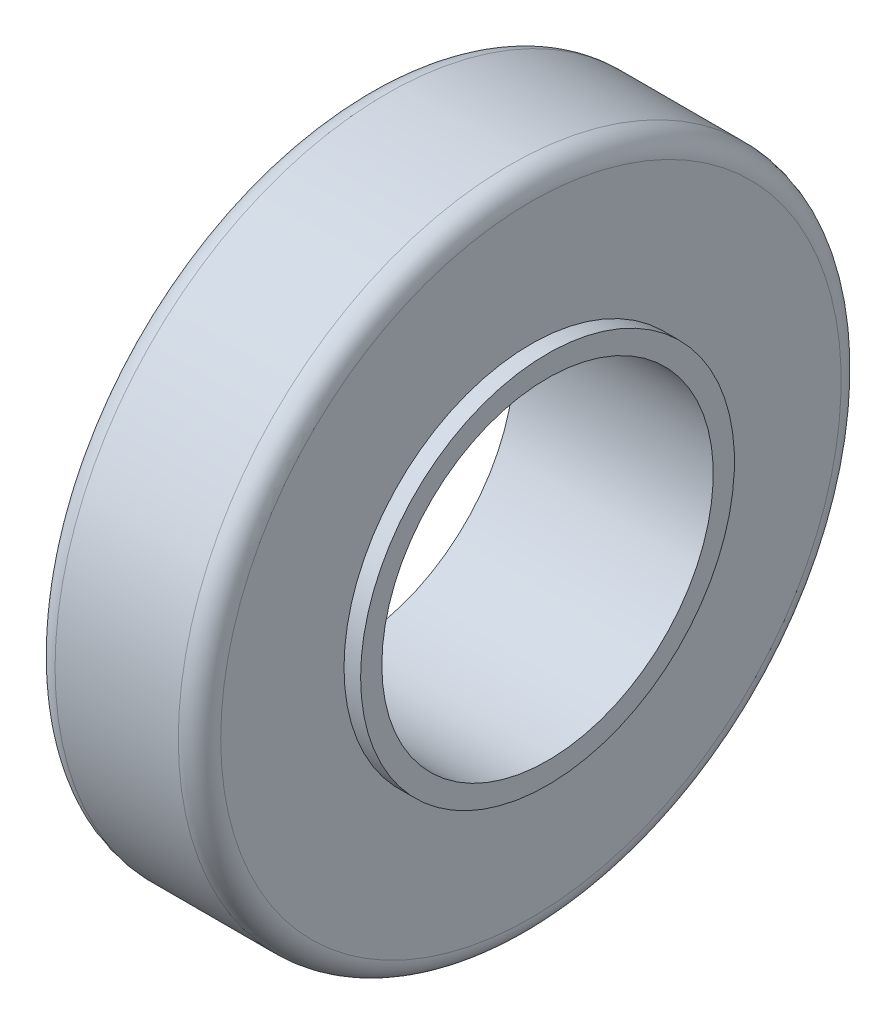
ISO-10303-21;
HEADER;
FILE_DESCRIPTION(('STEP AP214'),'2;1');
FILE_NAME('part.step','',(''),(''),'','','');
FILE_SCHEMA(('AUTOMOTIVE_DESIGN { 1 0 10303 214 1 1 1 1 }'));
ENDSEC;
DATA;
#1=APPLICATION_CONTEXT('core data for automotive mechanical design processes');
#2=APPLICATION_PROTOCOL_DEFINITION('international standard','automotive_design',2000,#1);
#3=PRODUCT_CONTEXT('',#1,'mechanical');
#4=PRODUCT('Part','Part','',(#3));
#5=PRODUCT_RELATED_PRODUCT_CATEGORY('part','',(#4));
#6=PRODUCT_DEFINITION_FORMATION('','',#4);
#7=PRODUCT_DEFINITION_CONTEXT('part definition',#1,'design');
#8=PRODUCT_DEFINITION('design','',#6,#7);
#9=PRODUCT_DEFINITION_SHAPE('','',#8);
#10=(LENGTH_UNIT() NAMED_UNIT(*) SI_UNIT(.MILLI.,.METRE.));
#11=(NAMED_UNIT(*) PLANE_ANGLE_UNIT() SI_UNIT($,.RADIAN.));
#12=(NAMED_UNIT(*) SI_UNIT($,.STERADIAN.) SOLID_ANGLE_UNIT());
#13=UNCERTAINTY_MEASURE_WITH_UNIT(LENGTH_MEASURE(1.E-05),#10,'distance_accuracy_value','');
#14=(GEOMETRIC_REPRESENTATION_CONTEXT(3) GLOBAL_UNCERTAINTY_ASSIGNED_CONTEXT((#13)) GLOBAL_UNIT_ASSIGNED_CONTEXT((#10,
#11,#12)) REPRESENTATION_CONTEXT('',''));
#15=CARTESIAN_POINT('',(0.,0.,0.));
#16=DIRECTION('',(0.,0.,1.));
#17=DIRECTION('',(1.,0.,0.));
#18=AXIS2_PLACEMENT_3D('',#15,#16,#17);
#19=CARTESIAN_POINT('',(-2.38125,4.47675,0.));
#20=DIRECTION('',(1.,0.,0.));
#21=DIRECTION('',(0.,0.,-1.));
#22=AXIS2_PLACEMENT_3D('',#19,#20,#21);
#23=PLANE('',#22);
#24=CARTESIAN_POINT('',(-2.38125,0.,0.));
#25=DIRECTION('',(-1.,0.,0.));
#26=DIRECTION('',(0.,0.,1.));
#27=AXIS2_PLACEMENT_3D('',#24,#25,#26);
#28=CIRCLE('',#27,3.96875);
#29=CARTESIAN_POINT('',(-2.38125,0.,3.96875));
#30=VERTEX_POINT('',#29);
#31=EDGE_CURVE('E52',#30,#30,#28,.T.);
#32=ORIENTED_EDGE('',*,*,#31,.F.);
#33=EDGE_LOOP('',(#32));
#34=FACE_BOUND('',#33,.T.);
#35=CARTESIAN_POINT('',(-2.38125,0.,0.));
#36=DIRECTION('',(-1.,0.,0.));
#37=DIRECTION('',(0.,0.,1.));
#38=AXIS2_PLACEMENT_3D('',#35,#36,#37);
#39=CIRCLE('',#38,4.47675);
#40=CARTESIAN_POINT('',(-2.38125,0.,4.47675));
#41=VERTEX_POINT('',#40);
#42=EDGE_CURVE('E67',#41,#41,#39,.T.);
#43=ORIENTED_EDGE('',*,*,#42,.T.);
#44=EDGE_LOOP('',(#43));
#45=FACE_BOUND('',#44,.T.);
#46=ADVANCED_FACE('F32',(#34,#45),#23,.F.);
#47=CARTESIAN_POINT('',(0.,0.,0.));
#48=DIRECTION('',(-1.,0.,0.));
#49=DIRECTION('',(0.,0.,1.));
#50=AXIS2_PLACEMENT_3D('',#47,#48,#49);
#51=CYLINDRICAL_SURFACE('',#50,3.96875);
#52=CARTESIAN_POINT('',(2.38125,0.,0.));
#53=DIRECTION('',(-1.,0.,0.));
#54=DIRECTION('',(0.,0.,1.));
#55=AXIS2_PLACEMENT_3D('',#52,#53,#54);
#56=CIRCLE('',#55,3.96875);
#57=CARTESIAN_POINT('',(2.38125,0.,3.96875));
#58=VERTEX_POINT('',#57);
#59=EDGE_CURVE('E55',#58,#58,#56,.T.);
#60=ORIENTED_EDGE('',*,*,#59,.F.);
#61=EDGE_LOOP('',(#60));
#62=FACE_BOUND('',#61,.T.);
#63=ORIENTED_EDGE('',*,*,#31,.T.);
#64=EDGE_LOOP('',(#63));
#65=FACE_BOUND('',#64,.T.);
#66=ADVANCED_FACE('F90',(#62,#65),#51,.F.);
#67=CARTESIAN_POINT('',(2.38125,3.96875,0.));
#68=DIRECTION('',(-1.,0.,0.));
#69=DIRECTION('',(0.,0.,1.));
#70=AXIS2_PLACEMENT_3D('',#67,#68,#69);
#71=PLANE('',#70);
#72=CARTESIAN_POINT('',(2.38125,0.,0.));
#73=DIRECTION('',(-1.,0.,0.));
#74=DIRECTION('',(0.,0.,1.));
#75=AXIS2_PLACEMENT_3D('',#72,#73,#74);
#76=CIRCLE('',#75,4.47675);
#77=CARTESIAN_POINT('',(2.38125,0.,4.47675));
#78=VERTEX_POINT('',#77);
#79=EDGE_CURVE('E58',#78,#78,#76,.T.);
#80=ORIENTED_EDGE('',*,*,#79,.F.);
#81=EDGE_LOOP('',(#80));
#82=FACE_BOUND('',#81,.T.);
#83=ORIENTED_EDGE('',*,*,#59,.T.);
#84=EDGE_LOOP('',(#83));
#85=FACE_BOUND('',#84,.T.);
#86=ADVANCED_FACE('F96',(#82,#85),#71,.F.);
#87=CARTESIAN_POINT('',(0.,0.,0.));
#88=DIRECTION('',(-1.,0.,0.));
#89=DIRECTION('',(0.,0.,1.));
#90=AXIS2_PLACEMENT_3D('',#87,#88,#89);
#91=CYLINDRICAL_SURFACE('',#90,4.47675);
#92=CARTESIAN_POINT('',(1.98374,0.,0.));
#93=DIRECTION('',(-1.,0.,0.));
#94=DIRECTION('',(0.,0.,1.));
#95=AXIS2_PLACEMENT_3D('',#92,#93,#94);
#96=CIRCLE('',#95,4.47675);
#97=CARTESIAN_POINT('',(1.98374,0.,4.47675));
#98=VERTEX_POINT('',#97);
#99=EDGE_CURVE('E61',#98,#98,#96,.T.);
#100=ORIENTED_EDGE('',*,*,#99,.F.);
#101=EDGE_LOOP('',(#100));
#102=FACE_BOUND('',#101,.T.);
#103=ORIENTED_EDGE('',*,*,#79,.T.);
#104=EDGE_LOOP('',(#103));
#105=FACE_BOUND('',#104,.T.);
#106=ADVANCED_FACE('F138',(#102,#105),#91,.T.);
#107=CARTESIAN_POINT('',(1.98374,4.47675,0.));
#108=DIRECTION('',(-1.,0.,0.));
#109=DIRECTION('',(0.,0.,1.));
#110=AXIS2_PLACEMENT_3D('',#107,#108,#109);
#111=PLANE('',#110);
#112=CARTESIAN_POINT('',(1.98374,0.,0.));
#113=DIRECTION('',(-1.,0.,0.));
#114=DIRECTION('',(0.,0.,1.));
#115=AXIS2_PLACEMENT_3D('',#112,#113,#114);
#116=CIRCLE('',#115,7.4295);
#117=CARTESIAN_POINT('',(1.98374,0.,7.4295));
#118=VERTEX_POINT('',#117);
#119=EDGE_CURVE('E10',#118,#118,#116,.F.);
#120=ORIENTED_EDGE('',*,*,#119,.T.);
#121=EDGE_LOOP('',(#120));
#122=FACE_BOUND('',#121,.T.);
#123=ORIENTED_EDGE('',*,*,#99,.T.);
#124=EDGE_LOOP('',(#123));
#125=FACE_BOUND('',#124,.T.);
#126=ADVANCED_FACE('F87',(#122,#125),#111,.F.);
#127=CARTESIAN_POINT('',(0.,0.,0.));
#128=DIRECTION('',(-1.,0.,0.));
#129=DIRECTION('',(0.,0.,1.));
#130=AXIS2_PLACEMENT_3D('',#127,#128,#129);
#131=CYLINDRICAL_SURFACE('',#130,7.9375);
#132=CARTESIAN_POINT('',(-1.47574,0.,0.));
#133=DIRECTION('',(1.,0.,0.));
#134=DIRECTION('',(0.,0.,-1.));
#135=AXIS2_PLACEMENT_3D('',#132,#133,#134);
#136=CIRCLE('',#135,7.9375);
#137=CARTESIAN_POINT('',(-1.47574,0.,-7.9375));
#138=VERTEX_POINT('',#137);
#139=EDGE_CURVE('E39',#138,#138,#136,.T.);
#140=ORIENTED_EDGE('',*,*,#139,.T.);
#141=EDGE_LOOP('',(#140));
#142=FACE_BOUND('',#141,.T.);
#143=CARTESIAN_POINT('',(1.47574,0.,0.));
#144=DIRECTION('',(-1.,0.,0.));
#145=DIRECTION('',(0.,0.,1.));
#146=AXIS2_PLACEMENT_3D('',#143,#144,#145);
#147=CIRCLE('',#146,7.9375);
#148=CARTESIAN_POINT('',(1.47574,0.,7.9375));
#149=VERTEX_POINT('',#148);
#150=EDGE_CURVE('E43',#149,#149,#147,.T.);
#151=ORIENTED_EDGE('',*,*,#150,.T.);
#152=EDGE_LOOP('',(#151));
#153=FACE_BOUND('',#152,.T.);
#154=ADVANCED_FACE('F81',(#142,#153),#131,.T.);
#155=CARTESIAN_POINT('',(-1.98374,7.9375,0.));
#156=DIRECTION('',(1.,0.,0.));
#157=DIRECTION('',(0.,0.,-1.));
#158=AXIS2_PLACEMENT_3D('',#155,#156,#157);
#159=PLANE('',#158);
#160=CARTESIAN_POINT('',(-1.98374,0.,0.));
#161=DIRECTION('',(1.,0.,0.));
#162=DIRECTION('',(0.,0.,-1.));
#163=AXIS2_PLACEMENT_3D('',#160,#161,#162);
#164=CIRCLE('',#163,7.4295);
#165=CARTESIAN_POINT('',(-1.98374,0.,-7.4295));
#166=VERTEX_POINT('',#165);
#167=EDGE_CURVE('E47',#166,#166,#164,.F.);
#168=ORIENTED_EDGE('',*,*,#167,.T.);
#169=EDGE_LOOP('',(#168));
#170=FACE_BOUND('',#169,.T.);
#171=CARTESIAN_POINT('',(-1.98374,0.,0.));
#172=DIRECTION('',(-1.,0.,0.));
#173=DIRECTION('',(0.,0.,1.));
#174=AXIS2_PLACEMENT_3D('',#171,#172,#173);
#175=CIRCLE('',#174,4.47675);
#176=CARTESIAN_POINT('',(-1.98374,0.,4.47675));
#177=VERTEX_POINT('',#176);
#178=EDGE_CURVE('E64',#177,#177,#175,.T.);
#179=ORIENTED_EDGE('',*,*,#178,.F.);
#180=EDGE_LOOP('',(#179));
#181=FACE_BOUND('',#180,.T.);
#182=ADVANCED_FACE('F76',(#170,#181),#159,.F.);
#183=CARTESIAN_POINT('',(0.,0.,0.));
#184=DIRECTION('',(-1.,0.,0.));
#185=DIRECTION('',(0.,0.,1.));
#186=AXIS2_PLACEMENT_3D('',#183,#184,#185);
#187=CYLINDRICAL_SURFACE('',#186,4.47675);
#188=ORIENTED_EDGE('',*,*,#42,.F.);
#189=EDGE_LOOP('',(#188));
#190=FACE_BOUND('',#189,.T.);
#191=ORIENTED_EDGE('',*,*,#178,.T.);
#192=EDGE_LOOP('',(#191));
#193=FACE_BOUND('',#192,.T.);
#194=ADVANCED_FACE('F72',(#190,#193),#187,.T.);
#195=CARTESIAN_POINT('',(-1.47574,0.,0.));
#196=DIRECTION('',(1.,0.,0.));
#197=DIRECTION('',(0.,0.,-1.));
#198=AXIS2_PLACEMENT_3D('',#195,#196,#197);
#199=TOROIDAL_SURFACE('',#198,7.4295,0.508);
#200=ORIENTED_EDGE('',*,*,#139,.F.);
#201=EDGE_LOOP('',(#200));
#202=FACE_BOUND('',#201,.T.);
#203=ORIENTED_EDGE('',*,*,#167,.F.);
#204=EDGE_LOOP('',(#203));
#205=FACE_BOUND('',#204,.T.);
#206=ADVANCED_FACE('F75',(#202,#205),#199,.T.);
#207=CARTESIAN_POINT('',(1.47574,0.,0.));
#208=DIRECTION('',(-1.,0.,0.));
#209=DIRECTION('',(0.,0.,1.));
#210=AXIS2_PLACEMENT_3D('',#207,#208,#209);
#211=TOROIDAL_SURFACE('',#210,7.4295,0.508);
#212=ORIENTED_EDGE('',*,*,#119,.F.);
#213=EDGE_LOOP('',(#212));
#214=FACE_BOUND('',#213,.T.);
#215=ORIENTED_EDGE('',*,*,#150,.F.);
#216=EDGE_LOOP('',(#215));
#217=FACE_BOUND('',#216,.T.);
#218=ADVANCED_FACE('F34',(#214,#217),#211,.T.);
#219=CLOSED_SHELL('',(#46,#66,#86,#106,#126,#154,#182,#194,#206,#218));
#220=MANIFOLD_SOLID_BREP('B2',#219);
#221=ADVANCED_BREP_SHAPE_REPRESENTATION('',(#18,#220),#14);
#222=SHAPE_DEFINITION_REPRESENTATION(#9,#221);
ENDSEC;
END-ISO-10303-21;
